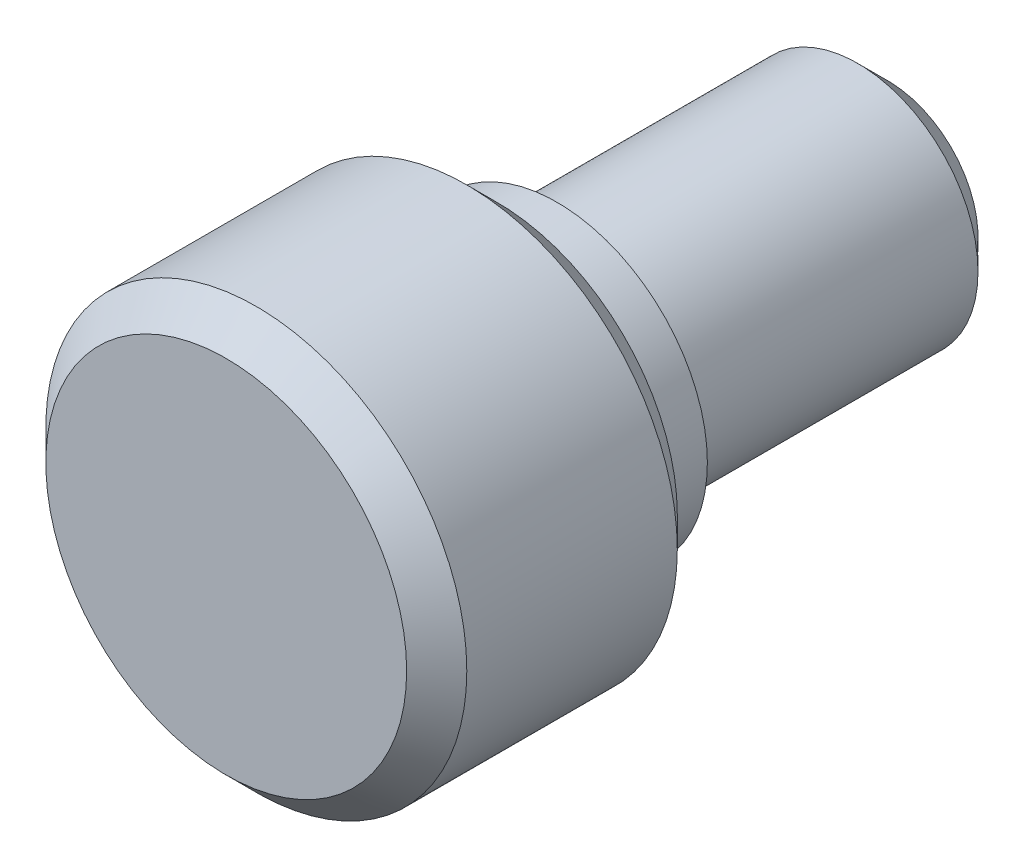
ISO-10303-21;
HEADER;
FILE_DESCRIPTION(('STEP AP214'),'2;1');
FILE_NAME('part.step','',(''),(''),'','','');
FILE_SCHEMA(('AUTOMOTIVE_DESIGN { 1 0 10303 214 1 1 1 1 }'));
ENDSEC;
DATA;
#1=APPLICATION_CONTEXT('core data for automotive mechanical design processes');
#2=APPLICATION_PROTOCOL_DEFINITION('international standard','automotive_design',2000,#1);
#3=PRODUCT_CONTEXT('',#1,'mechanical');
#4=PRODUCT('Part','Part','',(#3));
#5=PRODUCT_RELATED_PRODUCT_CATEGORY('part','',(#4));
#6=PRODUCT_DEFINITION_FORMATION('','',#4);
#7=PRODUCT_DEFINITION_CONTEXT('part definition',#1,'design');
#8=PRODUCT_DEFINITION('design','',#6,#7);
#9=PRODUCT_DEFINITION_SHAPE('','',#8);
#10=(LENGTH_UNIT() NAMED_UNIT(*) SI_UNIT(.MILLI.,.METRE.));
#11=(NAMED_UNIT(*) PLANE_ANGLE_UNIT() SI_UNIT($,.RADIAN.));
#12=(NAMED_UNIT(*) SI_UNIT($,.STERADIAN.) SOLID_ANGLE_UNIT());
#13=UNCERTAINTY_MEASURE_WITH_UNIT(LENGTH_MEASURE(1.E-05),#10,'distance_accuracy_value','');
#14=(GEOMETRIC_REPRESENTATION_CONTEXT(3) GLOBAL_UNCERTAINTY_ASSIGNED_CONTEXT((#13)) GLOBAL_UNIT_ASSIGNED_CONTEXT((#10,
#11,#12)) REPRESENTATION_CONTEXT('',''));
#15=CARTESIAN_POINT('',(0.,0.,0.));
#16=DIRECTION('',(0.,0.,1.));
#17=DIRECTION('',(1.,0.,0.));
#18=AXIS2_PLACEMENT_3D('',#15,#16,#17);
#19=CARTESIAN_POINT('',(0.,0.,-2.));
#20=DIRECTION('',(0.,0.,-1.));
#21=DIRECTION('',(-1.,0.,0.));
#22=AXIS2_PLACEMENT_3D('',#19,#20,#21);
#23=PLANE('',#22);
#24=CARTESIAN_POINT('',(0.,0.,-2.));
#25=DIRECTION('',(0.,0.,-1.));
#26=DIRECTION('',(-1.,0.,0.));
#27=AXIS2_PLACEMENT_3D('',#24,#25,#26);
#28=CIRCLE('',#27,5.);
#29=CARTESIAN_POINT('',(-5.,0.,-2.));
#30=VERTEX_POINT('',#29);
#31=EDGE_CURVE('E51',#30,#30,#28,.T.);
#32=ORIENTED_EDGE('',*,*,#31,.T.);
#33=EDGE_LOOP('',(#32));
#34=FACE_BOUND('',#33,.T.);
#35=CARTESIAN_POINT('',(0.,0.,-2.));
#36=DIRECTION('',(0.,0.,-1.));
#37=DIRECTION('',(-1.,0.,0.));
#38=AXIS2_PLACEMENT_3D('',#35,#36,#37);
#39=CIRCLE('',#38,4.);
#40=CARTESIAN_POINT('',(-4.,0.,-2.));
#41=VERTEX_POINT('',#40);
#42=EDGE_CURVE('E54',#41,#41,#39,.T.);
#43=ORIENTED_EDGE('',*,*,#42,.F.);
#44=EDGE_LOOP('',(#43));
#45=FACE_BOUND('',#44,.T.);
#46=ADVANCED_FACE('F22',(#34,#45),#23,.T.);
#47=CARTESIAN_POINT('',(0.,0.,0.));
#48=DIRECTION('',(0.,0.,1.));
#49=DIRECTION('',(1.,0.,0.));
#50=AXIS2_PLACEMENT_3D('',#47,#48,#49);
#51=PLANE('',#50);
#52=CARTESIAN_POINT('',(0.,0.,0.));
#53=DIRECTION('',(0.,0.,1.));
#54=DIRECTION('',(1.,0.,0.));
#55=AXIS2_PLACEMENT_3D('',#52,#53,#54);
#56=CIRCLE('',#55,5.99999999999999);
#57=CARTESIAN_POINT('',(5.99999999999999,0.,0.));
#58=VERTEX_POINT('',#57);
#59=EDGE_CURVE('E37',#58,#58,#56,.F.);
#60=ORIENTED_EDGE('',*,*,#59,.T.);
#61=EDGE_LOOP('',(#60));
#62=FACE_BOUND('',#61,.T.);
#63=CARTESIAN_POINT('',(0.,0.,0.));
#64=DIRECTION('',(0.,0.,1.));
#65=DIRECTION('',(1.,0.,0.));
#66=AXIS2_PLACEMENT_3D('',#63,#64,#65);
#67=CIRCLE('',#66,5.);
#68=CARTESIAN_POINT('',(5.,0.,0.));
#69=VERTEX_POINT('',#68);
#70=EDGE_CURVE('E33',#69,#69,#67,.F.);
#71=ORIENTED_EDGE('',*,*,#70,.F.);
#72=EDGE_LOOP('',(#71));
#73=FACE_BOUND('',#72,.T.);
#74=ADVANCED_FACE('F61',(#62,#73),#51,.F.);
#75=CARTESIAN_POINT('',(0.,0.,9.));
#76=DIRECTION('',(0.,0.,-1.));
#77=DIRECTION('',(-1.,0.,0.));
#78=AXIS2_PLACEMENT_3D('',#75,#76,#77);
#79=CYLINDRICAL_SURFACE('',#78,7.);
#80=CARTESIAN_POINT('',(0.,0.,8.));
#81=DIRECTION('',(0.,0.,1.));
#82=DIRECTION('',(1.,0.,0.));
#83=AXIS2_PLACEMENT_3D('',#80,#81,#82);
#84=CIRCLE('',#83,7.);
#85=CARTESIAN_POINT('',(7.,0.,8.));
#86=VERTEX_POINT('',#85);
#87=EDGE_CURVE('E42',#86,#86,#84,.F.);
#88=ORIENTED_EDGE('',*,*,#87,.T.);
#89=EDGE_LOOP('',(#88));
#90=FACE_BOUND('',#89,.T.);
#91=CARTESIAN_POINT('',(0.,0.,1.));
#92=DIRECTION('',(0.,0.,1.));
#93=DIRECTION('',(1.,0.,0.));
#94=AXIS2_PLACEMENT_3D('',#91,#92,#93);
#95=CIRCLE('',#94,7.);
#96=CARTESIAN_POINT('',(7.,0.,1.));
#97=VERTEX_POINT('',#96);
#98=EDGE_CURVE('E45',#97,#97,#95,.T.);
#99=ORIENTED_EDGE('',*,*,#98,.T.);
#100=EDGE_LOOP('',(#99));
#101=FACE_BOUND('',#100,.T.);
#102=ADVANCED_FACE('F24',(#90,#101),#79,.T.);
#103=CARTESIAN_POINT('',(0.,0.,9.));
#104=DIRECTION('',(0.,0.,1.));
#105=DIRECTION('',(1.,0.,0.));
#106=AXIS2_PLACEMENT_3D('',#103,#104,#105);
#107=PLANE('',#106);
#108=CARTESIAN_POINT('',(0.,0.,9.));
#109=DIRECTION('',(0.,0.,1.));
#110=DIRECTION('',(1.,0.,0.));
#111=AXIS2_PLACEMENT_3D('',#108,#109,#110);
#112=CIRCLE('',#111,6.);
#113=CARTESIAN_POINT('',(6.,0.,9.));
#114=VERTEX_POINT('',#113);
#115=EDGE_CURVE('E48',#114,#114,#112,.T.);
#116=ORIENTED_EDGE('',*,*,#115,.T.);
#117=EDGE_LOOP('',(#116));
#118=FACE_BOUND('',#117,.T.);
#119=ADVANCED_FACE('F82',(#118),#107,.T.);
#120=CARTESIAN_POINT('',(0.,0.,9.));
#121=DIRECTION('',(0.,0.,-1.));
#122=DIRECTION('',(-1.,0.,0.));
#123=AXIS2_PLACEMENT_3D('',#120,#121,#122);
#124=CONICAL_SURFACE('',#123,6.,0.785398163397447);
#125=ORIENTED_EDGE('',*,*,#87,.F.);
#126=EDGE_LOOP('',(#125));
#127=FACE_BOUND('',#126,.T.);
#128=ORIENTED_EDGE('',*,*,#115,.F.);
#129=EDGE_LOOP('',(#128));
#130=FACE_BOUND('',#129,.T.);
#131=ADVANCED_FACE('F79',(#127,#130),#124,.T.);
#132=CARTESIAN_POINT('',(0.,0.,1.));
#133=DIRECTION('',(0.,0.,1.));
#134=DIRECTION('',(1.,0.,0.));
#135=AXIS2_PLACEMENT_3D('',#132,#133,#134);
#136=CONICAL_SURFACE('',#135,7.,0.78539816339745);
#137=ORIENTED_EDGE('',*,*,#59,.F.);
#138=EDGE_LOOP('',(#137));
#139=FACE_BOUND('',#138,.T.);
#140=ORIENTED_EDGE('',*,*,#98,.F.);
#141=EDGE_LOOP('',(#140));
#142=FACE_BOUND('',#141,.T.);
#143=ADVANCED_FACE('F75',(#139,#142),#136,.T.);
#144=CARTESIAN_POINT('',(0.,0.,-2.));
#145=DIRECTION('',(0.,0.,1.));
#146=DIRECTION('',(1.,0.,0.));
#147=AXIS2_PLACEMENT_3D('',#144,#145,#146);
#148=CYLINDRICAL_SURFACE('',#147,5.);
#149=ORIENTED_EDGE('',*,*,#31,.F.);
#150=EDGE_LOOP('',(#149));
#151=FACE_BOUND('',#150,.T.);
#152=ORIENTED_EDGE('',*,*,#70,.T.);
#153=EDGE_LOOP('',(#152));
#154=FACE_BOUND('',#153,.T.);
#155=ADVANCED_FACE('F72',(#151,#154),#148,.T.);
#156=CARTESIAN_POINT('',(0.,0.,-13.));
#157=DIRECTION('',(0.,0.,1.));
#158=DIRECTION('',(1.,0.,0.));
#159=AXIS2_PLACEMENT_3D('',#156,#157,#158);
#160=CYLINDRICAL_SURFACE('',#159,4.);
#161=CARTESIAN_POINT('',(0.,0.,-12.));
#162=DIRECTION('',(0.,0.,-1.));
#163=DIRECTION('',(-1.,0.,0.));
#164=AXIS2_PLACEMENT_3D('',#161,#162,#163);
#165=CIRCLE('',#164,4.);
#166=CARTESIAN_POINT('',(-4.,0.,-12.));
#167=VERTEX_POINT('',#166);
#168=EDGE_CURVE('E10',#167,#167,#165,.F.);
#169=ORIENTED_EDGE('',*,*,#168,.T.);
#170=EDGE_LOOP('',(#169));
#171=FACE_BOUND('',#170,.T.);
#172=ORIENTED_EDGE('',*,*,#42,.T.);
#173=EDGE_LOOP('',(#172));
#174=FACE_BOUND('',#173,.T.);
#175=ADVANCED_FACE('F58',(#171,#174),#160,.T.);
#176=CARTESIAN_POINT('',(0.,0.,-13.));
#177=DIRECTION('',(0.,0.,-1.));
#178=DIRECTION('',(-1.,0.,0.));
#179=AXIS2_PLACEMENT_3D('',#176,#177,#178);
#180=PLANE('',#179);
#181=CARTESIAN_POINT('',(0.,0.,-13.));
#182=DIRECTION('',(0.,0.,-1.));
#183=DIRECTION('',(-1.,0.,0.));
#184=AXIS2_PLACEMENT_3D('',#181,#182,#183);
#185=CIRCLE('',#184,3.);
#186=CARTESIAN_POINT('',(-3.,0.,-13.));
#187=VERTEX_POINT('',#186);
#188=EDGE_CURVE('E29',#187,#187,#185,.T.);
#189=ORIENTED_EDGE('',*,*,#188,.T.);
#190=EDGE_LOOP('',(#189));
#191=FACE_BOUND('',#190,.T.);
#192=ADVANCED_FACE('F116',(#191),#180,.T.);
#193=CARTESIAN_POINT('',(0.,0.,-13.));
#194=DIRECTION('',(0.,0.,1.));
#195=DIRECTION('',(1.,0.,0.));
#196=AXIS2_PLACEMENT_3D('',#193,#194,#195);
#197=CONICAL_SURFACE('',#196,3.,0.785398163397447);
#198=ORIENTED_EDGE('',*,*,#168,.F.);
#199=EDGE_LOOP('',(#198));
#200=FACE_BOUND('',#199,.T.);
#201=ORIENTED_EDGE('',*,*,#188,.F.);
#202=EDGE_LOOP('',(#201));
#203=FACE_BOUND('',#202,.T.);
#204=ADVANCED_FACE('F122',(#200,#203),#197,.T.);
#205=CLOSED_SHELL('',(#46,#74,#102,#119,#131,#143,#155,#175,#192,#204));
#206=MANIFOLD_SOLID_BREP('B2',#205);
#207=ADVANCED_BREP_SHAPE_REPRESENTATION('',(#18,#206),#14);
#208=SHAPE_DEFINITION_REPRESENTATION(#9,#207);
ENDSEC;
END-ISO-10303-21;
